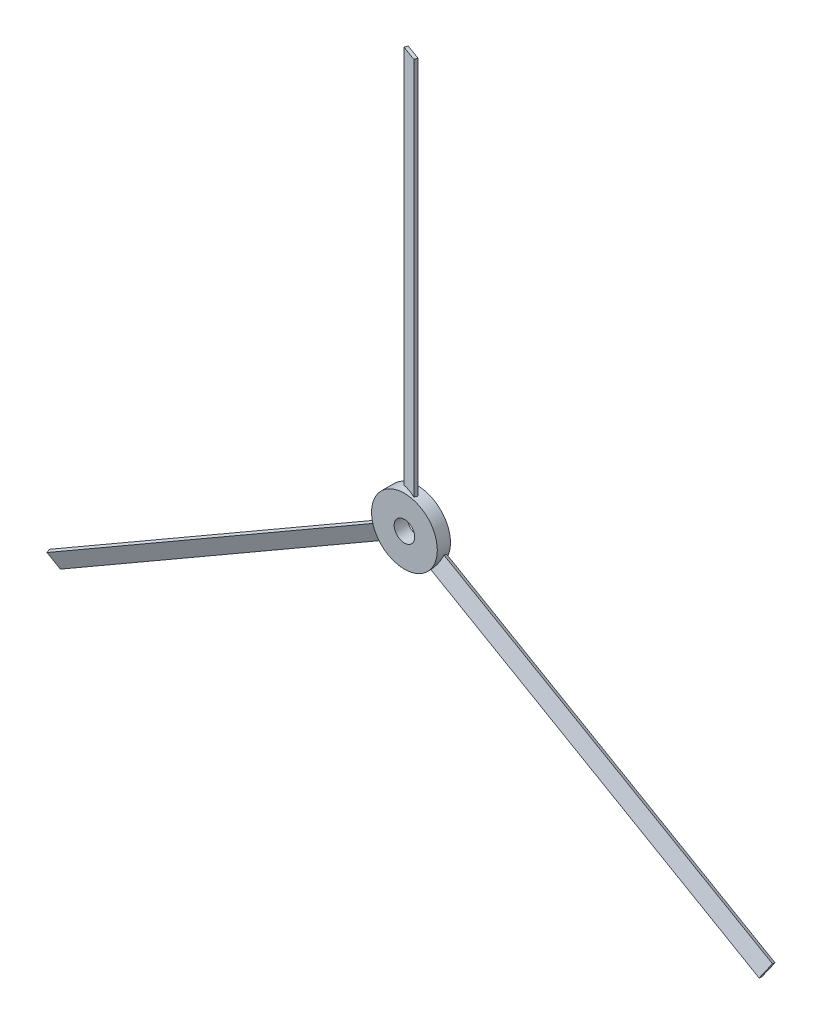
from build123d import *

# Parameters (mm, degrees)
SKETCH1_R          = 400
EXTRUDE1_DEPTH     = 80
EXTRUDE2_DEPTH     = 5000
CIRPATTERN1_COUNT  = 3
SKETCH3_R          = 125
CUT_EXTRUDE1_DEPTH = 6650.410447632


with BuildPart() as part:
    # Sketch1 → Extrude1 (new, symmetric)
    with BuildSketch(Plane.XY):
        Circle(SKETCH1_R)
    extrude(amount=EXTRUDE1_DEPTH, both=True)

    # Sketch2 → Extrude2 (add)
    with BuildSketch(Plane(origin=(0, 0, 0), x_dir=(1, 0, 0), z_dir=(0, 1, 0))):
        Polygon((-100.809664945, 15.408161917), (87.128859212, -52.995866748), (100.809664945, -15.408161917), (-87.128859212, 52.995866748), align=None)
    extrude2 = extrude(amount=EXTRUDE2_DEPTH)

    # CirPattern1: Extrude2 ×3 about axis
    cirpattern1_axis = Axis((0, 0, 0), (0, 0, 1))
    for i in range(1, CIRPATTERN1_COUNT):
        add(extrude2.rotate(cirpattern1_axis, i * 360 / CIRPATTERN1_COUNT))

    # Sketch3 → Cut-Extrude1 (cut, through all)
    with BuildSketch(Plane.XY.offset(80)):
        Circle(SKETCH3_R)
    extrude(amount=-CUT_EXTRUDE1_DEPTH, mode=Mode.SUBTRACT)


solid = part.part
